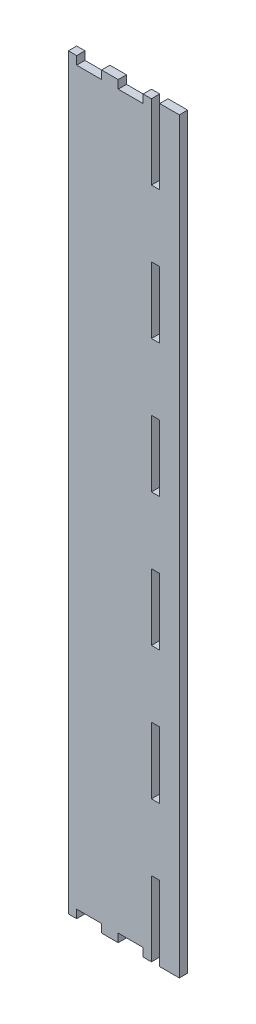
from build123d import *

# Parameters (mm, degrees)
MODEL_W             = 5
MODEL_H             = 40
BOSS_EXTRUDE1_DEPTH = 5


with BuildPart() as part:
    # Model → Boss-Extrude1 (new body)
    with BuildSketch(Plane.XY):
        Polygon((156.685694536, -243.658217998), (156.685694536, -238.658217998), (141.685694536, -238.658217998), (141.685694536, -243.658217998), (136.685694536, -243.658217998), (136.685694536, 206.341782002), (141.685694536, 206.341782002), (141.685694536, 201.341782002), (156.685694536, 201.341782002), (156.685694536, 206.341782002), (166.685694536, 206.341782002), (166.685694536, 201.341782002), (181.685694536, 201.341782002), (181.685694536, 206.341782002), (186.685694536, 206.341782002), (186.685694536, 161.341782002), (191.685694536, 161.341782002), (191.685694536, 206.341782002), (203.486718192, 206.341782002), (203.486718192, -243.658217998), (191.685694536, -243.658217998), (191.685694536, -198.658217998), (186.685694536, -198.658217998), (186.685694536, -243.658217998), (181.685694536, -243.658217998), (181.685694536, -238.658217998), (166.685694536, -238.658217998), (166.685694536, -243.658217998), align=None)
        with Locations((189.185694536, -138.658217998)):
            Rectangle(MODEL_W, MODEL_H, mode=Mode.SUBTRACT)
        with Locations((189.185694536, 101.341782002)):
            Rectangle(MODEL_W, MODEL_H, mode=Mode.SUBTRACT)
        with Locations((189.185694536, 21.341782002)):
            Rectangle(MODEL_W, MODEL_H, mode=Mode.SUBTRACT)
        with Locations((189.185694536, -58.658217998)):
            Rectangle(MODEL_W, MODEL_H, mode=Mode.SUBTRACT)
    extrude(amount=BOSS_EXTRUDE1_DEPTH)


solid = part.part
